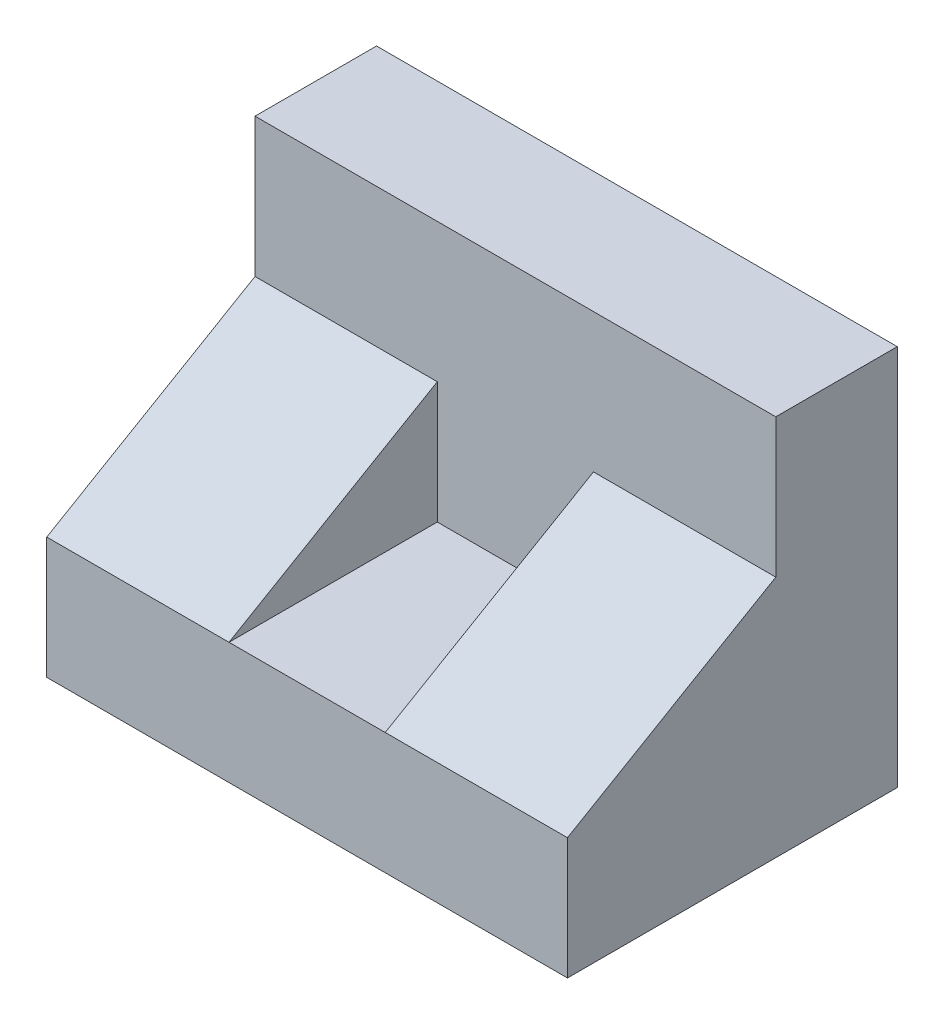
ISO-10303-21;
HEADER;
FILE_DESCRIPTION(('STEP AP214'),'2;1');
FILE_NAME('part.step','',(''),(''),'','','');
FILE_SCHEMA(('AUTOMOTIVE_DESIGN { 1 0 10303 214 1 1 1 1 }'));
ENDSEC;
DATA;
#1=APPLICATION_CONTEXT('core data for automotive mechanical design processes');
#2=APPLICATION_PROTOCOL_DEFINITION('international standard','automotive_design',2000,#1);
#3=PRODUCT_CONTEXT('',#1,'mechanical');
#4=PRODUCT('Part','Part','',(#3));
#5=PRODUCT_RELATED_PRODUCT_CATEGORY('part','',(#4));
#6=PRODUCT_DEFINITION_FORMATION('','',#4);
#7=PRODUCT_DEFINITION_CONTEXT('part definition',#1,'design');
#8=PRODUCT_DEFINITION('design','',#6,#7);
#9=PRODUCT_DEFINITION_SHAPE('','',#8);
#10=(LENGTH_UNIT() NAMED_UNIT(*) SI_UNIT(.MILLI.,.METRE.));
#11=(NAMED_UNIT(*) PLANE_ANGLE_UNIT() SI_UNIT($,.RADIAN.));
#12=(NAMED_UNIT(*) SI_UNIT($,.STERADIAN.) SOLID_ANGLE_UNIT());
#13=UNCERTAINTY_MEASURE_WITH_UNIT(LENGTH_MEASURE(1.E-05),#10,'distance_accuracy_value','');
#14=(GEOMETRIC_REPRESENTATION_CONTEXT(3) GLOBAL_UNCERTAINTY_ASSIGNED_CONTEXT((#13)) GLOBAL_UNIT_ASSIGNED_CONTEXT((#10,
#11,#12)) REPRESENTATION_CONTEXT('',''));
#15=CARTESIAN_POINT('',(0.,0.,0.));
#16=DIRECTION('',(0.,0.,1.));
#17=DIRECTION('',(1.,0.,0.));
#18=AXIS2_PLACEMENT_3D('',#15,#16,#17);
#19=CARTESIAN_POINT('',(15.,-15.,19.));
#20=DIRECTION('',(0.,-0.863778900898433,-0.503871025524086));
#21=DIRECTION('',(0.,0.503871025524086,-0.863778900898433));
#22=AXIS2_PLACEMENT_3D('',#19,#20,#21);
#23=PLANE('',#22);
#24=DIRECTION('',(0.,-0.503871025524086,0.863778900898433));
#25=VECTOR('',#24,1.);
#26=CARTESIAN_POINT('',(-4.5,-8.,7.));
#27=LINE('',#26,#25);
#28=CARTESIAN_POINT('',(-4.5,-8.,7.));
#29=VERTEX_POINT('',#28);
#30=CARTESIAN_POINT('',(-4.5,-15.,19.));
#31=VERTEX_POINT('',#30);
#32=EDGE_CURVE('E46',#29,#31,#27,.T.);
#33=ORIENTED_EDGE('',*,*,#32,.F.);
#34=DIRECTION('',(-1.,0.,0.));
#35=VECTOR('',#34,1.);
#36=CARTESIAN_POINT('',(15.,-8.,7.));
#37=LINE('',#36,#35);
#38=CARTESIAN_POINT('',(-15.,-8.,7.));
#39=VERTEX_POINT('',#38);
#40=EDGE_CURVE('E146',#29,#39,#37,.T.);
#41=ORIENTED_EDGE('',*,*,#40,.T.);
#42=DIRECTION('',(0.,-0.503871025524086,0.863778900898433));
#43=VECTOR('',#42,1.);
#44=CARTESIAN_POINT('',(-15.,-15.,19.));
#45=LINE('',#44,#43);
#46=CARTESIAN_POINT('',(-15.,-15.,19.));
#47=VERTEX_POINT('',#46);
#48=EDGE_CURVE('E135',#39,#47,#45,.T.);
#49=ORIENTED_EDGE('',*,*,#48,.T.);
#50=DIRECTION('',(-1.,0.,0.));
#51=VECTOR('',#50,1.);
#52=CARTESIAN_POINT('',(15.,-15.,19.));
#53=LINE('',#52,#51);
#54=EDGE_CURVE('E119',#31,#47,#53,.T.);
#55=ORIENTED_EDGE('',*,*,#54,.F.);
#56=EDGE_LOOP('',(#33,#41,#49,#55));
#57=FACE_BOUND('',#56,.T.);
#58=ADVANCED_FACE('F31',(#57),#23,.F.);
#59=CARTESIAN_POINT('',(15.,0.,7.));
#60=DIRECTION('',(0.,-1.,0.));
#61=DIRECTION('',(0.,0.,-1.));
#62=AXIS2_PLACEMENT_3D('',#59,#60,#61);
#63=PLANE('',#62);
#64=DIRECTION('',(0.,0.,1.));
#65=VECTOR('',#64,1.);
#66=CARTESIAN_POINT('',(-15.,0.,7.));
#67=LINE('',#66,#65);
#68=CARTESIAN_POINT('',(-15.,0.,0.));
#69=VERTEX_POINT('',#68);
#70=CARTESIAN_POINT('',(-15.,0.,7.));
#71=VERTEX_POINT('',#70);
#72=EDGE_CURVE('E128',#69,#71,#67,.T.);
#73=ORIENTED_EDGE('',*,*,#72,.T.);
#74=DIRECTION('',(-1.,0.,0.));
#75=VECTOR('',#74,1.);
#76=CARTESIAN_POINT('',(15.,0.,7.));
#77=LINE('',#76,#75);
#78=CARTESIAN_POINT('',(15.,0.,7.));
#79=VERTEX_POINT('',#78);
#80=EDGE_CURVE('E11',#79,#71,#77,.T.);
#81=ORIENTED_EDGE('',*,*,#80,.F.);
#82=DIRECTION('',(0.,0.,1.));
#83=VECTOR('',#82,1.);
#84=CARTESIAN_POINT('',(15.,0.,7.));
#85=LINE('',#84,#83);
#86=CARTESIAN_POINT('',(15.,0.,0.));
#87=VERTEX_POINT('',#86);
#88=EDGE_CURVE('E142',#87,#79,#85,.T.);
#89=ORIENTED_EDGE('',*,*,#88,.F.);
#90=DIRECTION('',(-1.,0.,0.));
#91=VECTOR('',#90,1.);
#92=CARTESIAN_POINT('',(15.,0.,0.));
#93=LINE('',#92,#91);
#94=EDGE_CURVE('E124',#87,#69,#93,.T.);
#95=ORIENTED_EDGE('',*,*,#94,.T.);
#96=EDGE_LOOP('',(#73,#81,#89,#95));
#97=FACE_BOUND('',#96,.T.);
#98=ADVANCED_FACE('F33',(#97),#63,.F.);
#99=CARTESIAN_POINT('',(15.,-8.,7.));
#100=DIRECTION('',(0.,0.,-1.));
#101=DIRECTION('',(-1.,0.,0.));
#102=AXIS2_PLACEMENT_3D('',#99,#100,#101);
#103=PLANE('',#102);
#104=DIRECTION('',(0.,-1.,0.));
#105=VECTOR('',#104,1.);
#106=CARTESIAN_POINT('',(-15.,-8.,7.));
#107=LINE('',#106,#105);
#108=EDGE_CURVE('E131',#71,#39,#107,.T.);
#109=ORIENTED_EDGE('',*,*,#108,.T.);
#110=ORIENTED_EDGE('',*,*,#40,.F.);
#111=DIRECTION('',(0.,1.,0.));
#112=VECTOR('',#111,1.);
#113=CARTESIAN_POINT('',(-4.5,-8.,7.));
#114=LINE('',#113,#112);
#115=CARTESIAN_POINT('',(-4.5,-15.,7.));
#116=VERTEX_POINT('',#115);
#117=EDGE_CURVE('E169',#116,#29,#114,.T.);
#118=ORIENTED_EDGE('',*,*,#117,.F.);
#119=DIRECTION('',(1.,0.,0.));
#120=VECTOR('',#119,1.);
#121=CARTESIAN_POINT('',(-4.5,-15.,7.));
#122=LINE('',#121,#120);
#123=CARTESIAN_POINT('',(4.5,-15.,7.));
#124=VERTEX_POINT('',#123);
#125=EDGE_CURVE('E132',#116,#124,#122,.T.);
#126=ORIENTED_EDGE('',*,*,#125,.T.);
#127=DIRECTION('',(0.,1.,0.));
#128=VECTOR('',#127,1.);
#129=CARTESIAN_POINT('',(4.5,-8.,7.));
#130=LINE('',#129,#128);
#131=CARTESIAN_POINT('',(4.5,-8.,7.));
#132=VERTEX_POINT('',#131);
#133=EDGE_CURVE('E172',#124,#132,#130,.T.);
#134=ORIENTED_EDGE('',*,*,#133,.T.);
#135=CARTESIAN_POINT('',(15.,-8.,7.));
#136=VERTEX_POINT('',#135);
#137=EDGE_CURVE('E39',#136,#132,#37,.T.);
#138=ORIENTED_EDGE('',*,*,#137,.F.);
#139=DIRECTION('',(0.,-1.,0.));
#140=VECTOR('',#139,1.);
#141=CARTESIAN_POINT('',(15.,-8.,7.));
#142=LINE('',#141,#140);
#143=EDGE_CURVE('E90',#79,#136,#142,.T.);
#144=ORIENTED_EDGE('',*,*,#143,.F.);
#145=ORIENTED_EDGE('',*,*,#80,.T.);
#146=EDGE_LOOP('',(#109,#110,#118,#126,#134,#138,#144,#145));
#147=FACE_BOUND('',#146,.T.);
#148=ADVANCED_FACE('F155',(#147),#103,.F.);
#149=ORIENTED_EDGE('',*,*,#137,.T.);
#150=DIRECTION('',(0.,-0.503871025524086,0.863778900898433));
#151=VECTOR('',#150,1.);
#152=CARTESIAN_POINT('',(4.5,-8.,7.));
#153=LINE('',#152,#151);
#154=CARTESIAN_POINT('',(4.5,-15.,19.));
#155=VERTEX_POINT('',#154);
#156=EDGE_CURVE('E178',#132,#155,#153,.T.);
#157=ORIENTED_EDGE('',*,*,#156,.T.);
#158=CARTESIAN_POINT('',(15.,-15.,19.));
#159=VERTEX_POINT('',#158);
#160=EDGE_CURVE('E145',#159,#155,#53,.T.);
#161=ORIENTED_EDGE('',*,*,#160,.F.);
#162=DIRECTION('',(0.,-0.503871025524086,0.863778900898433));
#163=VECTOR('',#162,1.);
#164=CARTESIAN_POINT('',(15.,-15.,19.));
#165=LINE('',#164,#163);
#166=EDGE_CURVE('E107',#136,#159,#165,.T.);
#167=ORIENTED_EDGE('',*,*,#166,.F.);
#168=EDGE_LOOP('',(#149,#157,#161,#167));
#169=FACE_BOUND('',#168,.T.);
#170=ADVANCED_FACE('F197',(#169),#23,.F.);
#171=CARTESIAN_POINT('',(15.,-22.,19.));
#172=DIRECTION('',(0.,0.,-1.));
#173=DIRECTION('',(-1.,0.,0.));
#174=AXIS2_PLACEMENT_3D('',#171,#172,#173);
#175=PLANE('',#174);
#176=DIRECTION('',(0.,-1.,0.));
#177=VECTOR('',#176,1.);
#178=CARTESIAN_POINT('',(-15.,-22.,19.));
#179=LINE('',#178,#177);
#180=CARTESIAN_POINT('',(-15.,-22.,19.));
#181=VERTEX_POINT('',#180);
#182=EDGE_CURVE('E116',#47,#181,#179,.T.);
#183=ORIENTED_EDGE('',*,*,#182,.T.);
#184=DIRECTION('',(-1.,0.,0.));
#185=VECTOR('',#184,1.);
#186=CARTESIAN_POINT('',(15.,-22.,19.));
#187=LINE('',#186,#185);
#188=CARTESIAN_POINT('',(15.,-22.,19.));
#189=VERTEX_POINT('',#188);
#190=EDGE_CURVE('E113',#189,#181,#187,.T.);
#191=ORIENTED_EDGE('',*,*,#190,.F.);
#192=DIRECTION('',(0.,-1.,0.));
#193=VECTOR('',#192,1.);
#194=CARTESIAN_POINT('',(15.,-22.,19.));
#195=LINE('',#194,#193);
#196=EDGE_CURVE('E100',#159,#189,#195,.T.);
#197=ORIENTED_EDGE('',*,*,#196,.F.);
#198=ORIENTED_EDGE('',*,*,#160,.T.);
#199=DIRECTION('',(1.,0.,0.));
#200=VECTOR('',#199,1.);
#201=CARTESIAN_POINT('',(-4.5,-15.,19.));
#202=LINE('',#201,#200);
#203=EDGE_CURVE('E166',#31,#155,#202,.T.);
#204=ORIENTED_EDGE('',*,*,#203,.F.);
#205=ORIENTED_EDGE('',*,*,#54,.T.);
#206=EDGE_LOOP('',(#183,#191,#197,#198,#204,#205));
#207=FACE_BOUND('',#206,.T.);
#208=ADVANCED_FACE('F114',(#207),#175,.F.);
#209=CARTESIAN_POINT('',(15.,-22.,0.));
#210=DIRECTION('',(0.,1.,0.));
#211=DIRECTION('',(0.,0.,1.));
#212=AXIS2_PLACEMENT_3D('',#209,#210,#211);
#213=PLANE('',#212);
#214=DIRECTION('',(0.,0.,-1.));
#215=VECTOR('',#214,1.);
#216=CARTESIAN_POINT('',(-15.,-22.,0.));
#217=LINE('',#216,#215);
#218=CARTESIAN_POINT('',(-15.,-22.,0.));
#219=VERTEX_POINT('',#218);
#220=EDGE_CURVE('E139',#181,#219,#217,.T.);
#221=ORIENTED_EDGE('',*,*,#220,.T.);
#222=DIRECTION('',(-1.,0.,0.));
#223=VECTOR('',#222,1.);
#224=CARTESIAN_POINT('',(15.,-22.,0.));
#225=LINE('',#224,#223);
#226=CARTESIAN_POINT('',(15.,-22.,0.));
#227=VERTEX_POINT('',#226);
#228=EDGE_CURVE('E120',#227,#219,#225,.T.);
#229=ORIENTED_EDGE('',*,*,#228,.F.);
#230=DIRECTION('',(0.,0.,-1.));
#231=VECTOR('',#230,1.);
#232=CARTESIAN_POINT('',(15.,-22.,0.));
#233=LINE('',#232,#231);
#234=EDGE_CURVE('E104',#189,#227,#233,.T.);
#235=ORIENTED_EDGE('',*,*,#234,.F.);
#236=ORIENTED_EDGE('',*,*,#190,.T.);
#237=EDGE_LOOP('',(#221,#229,#235,#236));
#238=FACE_BOUND('',#237,.T.);
#239=ADVANCED_FACE('F122',(#238),#213,.F.);
#240=CARTESIAN_POINT('',(15.,0.,0.));
#241=DIRECTION('',(0.,0.,1.));
#242=DIRECTION('',(0.,-1.,0.));
#243=AXIS2_PLACEMENT_3D('',#240,#241,#242);
#244=PLANE('',#243);
#245=DIRECTION('',(0.,1.,0.));
#246=VECTOR('',#245,1.);
#247=CARTESIAN_POINT('',(-15.,0.,0.));
#248=LINE('',#247,#246);
#249=EDGE_CURVE('E82',#219,#69,#248,.T.);
#250=ORIENTED_EDGE('',*,*,#249,.T.);
#251=ORIENTED_EDGE('',*,*,#94,.F.);
#252=DIRECTION('',(0.,1.,0.));
#253=VECTOR('',#252,1.);
#254=CARTESIAN_POINT('',(15.,0.,0.));
#255=LINE('',#254,#253);
#256=EDGE_CURVE('E55',#227,#87,#255,.T.);
#257=ORIENTED_EDGE('',*,*,#256,.F.);
#258=ORIENTED_EDGE('',*,*,#228,.T.);
#259=EDGE_LOOP('',(#250,#251,#257,#258));
#260=FACE_BOUND('',#259,.T.);
#261=ADVANCED_FACE('F160',(#260),#244,.F.);
#262=CARTESIAN_POINT('',(15.,0.,19.));
#263=DIRECTION('',(1.,0.,0.));
#264=DIRECTION('',(0.,0.,-1.));
#265=AXIS2_PLACEMENT_3D('',#262,#263,#264);
#266=PLANE('',#265);
#267=ORIENTED_EDGE('',*,*,#88,.T.);
#268=ORIENTED_EDGE('',*,*,#143,.T.);
#269=ORIENTED_EDGE('',*,*,#166,.T.);
#270=ORIENTED_EDGE('',*,*,#196,.T.);
#271=ORIENTED_EDGE('',*,*,#234,.T.);
#272=ORIENTED_EDGE('',*,*,#256,.T.);
#273=EDGE_LOOP('',(#267,#268,#269,#270,#271,#272));
#274=FACE_BOUND('',#273,.T.);
#275=ADVANCED_FACE('F102',(#274),#266,.T.);
#276=CARTESIAN_POINT('',(-15.,0.,19.));
#277=DIRECTION('',(1.,0.,0.));
#278=DIRECTION('',(0.,0.,-1.));
#279=AXIS2_PLACEMENT_3D('',#276,#277,#278);
#280=PLANE('',#279);
#281=ORIENTED_EDGE('',*,*,#72,.F.);
#282=ORIENTED_EDGE('',*,*,#249,.F.);
#283=ORIENTED_EDGE('',*,*,#220,.F.);
#284=ORIENTED_EDGE('',*,*,#182,.F.);
#285=ORIENTED_EDGE('',*,*,#48,.F.);
#286=ORIENTED_EDGE('',*,*,#108,.F.);
#287=EDGE_LOOP('',(#281,#282,#283,#284,#285,#286));
#288=FACE_BOUND('',#287,.T.);
#289=ADVANCED_FACE('F159',(#288),#280,.F.);
#290=CARTESIAN_POINT('',(-4.5,-15.,7.));
#291=DIRECTION('',(0.,-1.,0.));
#292=DIRECTION('',(0.,0.,-1.));
#293=AXIS2_PLACEMENT_3D('',#290,#291,#292);
#294=PLANE('',#293);
#295=DIRECTION('',(0.,0.,-1.));
#296=VECTOR('',#295,1.);
#297=CARTESIAN_POINT('',(4.5,-15.,7.));
#298=LINE('',#297,#296);
#299=EDGE_CURVE('E175',#155,#124,#298,.T.);
#300=ORIENTED_EDGE('',*,*,#299,.T.);
#301=ORIENTED_EDGE('',*,*,#125,.F.);
#302=DIRECTION('',(0.,0.,-1.));
#303=VECTOR('',#302,1.);
#304=CARTESIAN_POINT('',(-4.5,-15.,7.));
#305=LINE('',#304,#303);
#306=EDGE_CURVE('E181',#31,#116,#305,.T.);
#307=ORIENTED_EDGE('',*,*,#306,.F.);
#308=ORIENTED_EDGE('',*,*,#203,.T.);
#309=EDGE_LOOP('',(#300,#301,#307,#308));
#310=FACE_BOUND('',#309,.T.);
#311=ADVANCED_FACE('F192',(#310),#294,.F.);
#312=CARTESIAN_POINT('',(-4.5,-8.,7.));
#313=DIRECTION('',(1.,0.,0.));
#314=DIRECTION('',(0.,0.,-1.));
#315=AXIS2_PLACEMENT_3D('',#312,#313,#314);
#316=PLANE('',#315);
#317=ORIENTED_EDGE('',*,*,#32,.T.);
#318=ORIENTED_EDGE('',*,*,#306,.T.);
#319=ORIENTED_EDGE('',*,*,#117,.T.);
#320=EDGE_LOOP('',(#317,#318,#319));
#321=FACE_BOUND('',#320,.T.);
#322=ADVANCED_FACE('F184',(#321),#316,.T.);
#323=CARTESIAN_POINT('',(4.5,-8.,7.));
#324=DIRECTION('',(1.,0.,0.));
#325=DIRECTION('',(0.,0.,-1.));
#326=AXIS2_PLACEMENT_3D('',#323,#324,#325);
#327=PLANE('',#326);
#328=ORIENTED_EDGE('',*,*,#156,.F.);
#329=ORIENTED_EDGE('',*,*,#133,.F.);
#330=ORIENTED_EDGE('',*,*,#299,.F.);
#331=EDGE_LOOP('',(#328,#329,#330));
#332=FACE_BOUND('',#331,.T.);
#333=ADVANCED_FACE('F196',(#332),#327,.F.);
#334=CLOSED_SHELL('',(#58,#98,#148,#170,#208,#239,#261,#275,#289,#311,#322,#333));
#335=MANIFOLD_SOLID_BREP('B2',#334);
#336=ADVANCED_BREP_SHAPE_REPRESENTATION('',(#18,#335),#14);
#337=SHAPE_DEFINITION_REPRESENTATION(#9,#336);
ENDSEC;
END-ISO-10303-21;
